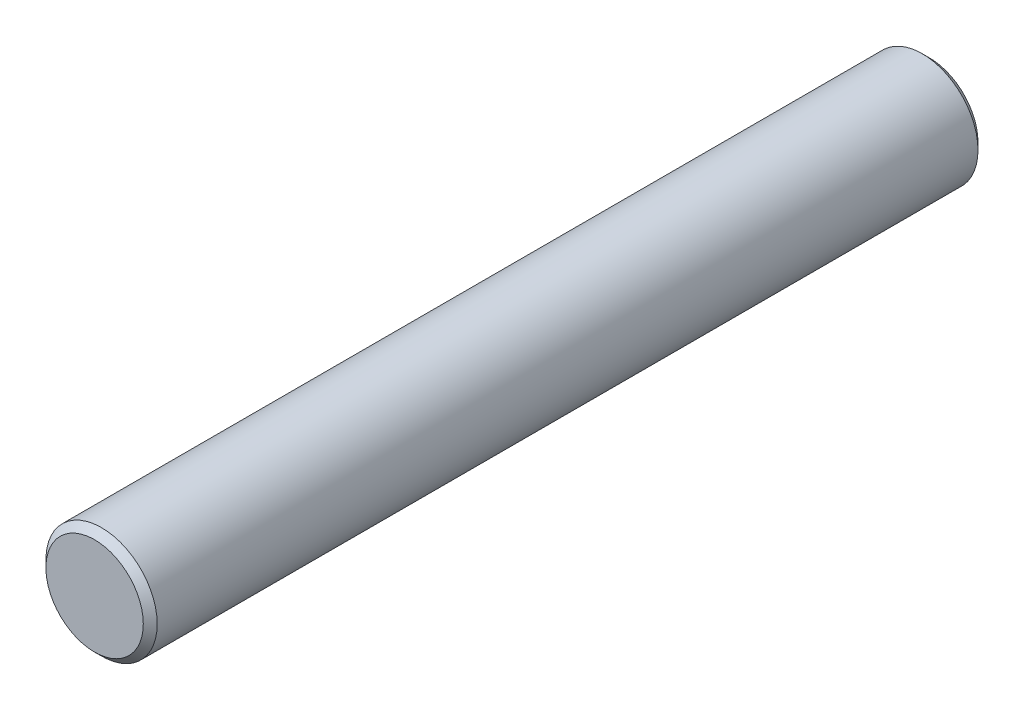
ISO-10303-21;
HEADER;
FILE_DESCRIPTION(('STEP AP214'),'2;1');
FILE_NAME('part.step','',(''),(''),'','','');
FILE_SCHEMA(('AUTOMOTIVE_DESIGN { 1 0 10303 214 1 1 1 1 }'));
ENDSEC;
DATA;
#1=APPLICATION_CONTEXT('core data for automotive mechanical design processes');
#2=APPLICATION_PROTOCOL_DEFINITION('international standard','automotive_design',2000,#1);
#3=PRODUCT_CONTEXT('',#1,'mechanical');
#4=PRODUCT('Part','Part','',(#3));
#5=PRODUCT_RELATED_PRODUCT_CATEGORY('part','',(#4));
#6=PRODUCT_DEFINITION_FORMATION('','',#4);
#7=PRODUCT_DEFINITION_CONTEXT('part definition',#1,'design');
#8=PRODUCT_DEFINITION('design','',#6,#7);
#9=PRODUCT_DEFINITION_SHAPE('','',#8);
#10=(LENGTH_UNIT() NAMED_UNIT(*) SI_UNIT(.MILLI.,.METRE.));
#11=(NAMED_UNIT(*) PLANE_ANGLE_UNIT() SI_UNIT($,.RADIAN.));
#12=(NAMED_UNIT(*) SI_UNIT($,.STERADIAN.) SOLID_ANGLE_UNIT());
#13=UNCERTAINTY_MEASURE_WITH_UNIT(LENGTH_MEASURE(1.E-05),#10,'distance_accuracy_value','');
#14=(GEOMETRIC_REPRESENTATION_CONTEXT(3) GLOBAL_UNCERTAINTY_ASSIGNED_CONTEXT((#13)) GLOBAL_UNIT_ASSIGNED_CONTEXT((#10,
#11,#12)) REPRESENTATION_CONTEXT('',''));
#15=CARTESIAN_POINT('',(0.,0.,0.));
#16=DIRECTION('',(0.,0.,1.));
#17=DIRECTION('',(1.,0.,0.));
#18=AXIS2_PLACEMENT_3D('',#15,#16,#17);
#19=CARTESIAN_POINT('',(0.,1.38777878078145E-13,120.));
#20=DIRECTION('',(0.,0.,-1.));
#21=DIRECTION('',(-1.00000000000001,0.,0.));
#22=AXIS2_PLACEMENT_3D('',#19,#20,#21);
#23=CYLINDRICAL_SURFACE('',#22,8.);
#24=CARTESIAN_POINT('',(1.11022302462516E-13,0.,119.));
#25=DIRECTION('',(0.,0.,1.));
#26=DIRECTION('',(1.00000000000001,0.,0.));
#27=AXIS2_PLACEMENT_3D('',#24,#25,#26);
#28=CIRCLE('',#27,8.);
#29=CARTESIAN_POINT('',(8.00000000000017,0.,119.));
#30=VERTEX_POINT('',#29);
#31=EDGE_CURVE('E33',#30,#30,#28,.F.);
#32=ORIENTED_EDGE('',*,*,#31,.T.);
#33=EDGE_LOOP('',(#32));
#34=FACE_BOUND('',#33,.T.);
#35=CARTESIAN_POINT('',(0.,0.,1.));
#36=DIRECTION('',(0.,0.,1.));
#37=DIRECTION('',(1.00000000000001,0.,0.));
#38=AXIS2_PLACEMENT_3D('',#35,#36,#37);
#39=CIRCLE('',#38,8.);
#40=CARTESIAN_POINT('',(8.00000000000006,0.,1.));
#41=VERTEX_POINT('',#40);
#42=EDGE_CURVE('E37',#41,#41,#39,.T.);
#43=ORIENTED_EDGE('',*,*,#42,.T.);
#44=EDGE_LOOP('',(#43));
#45=FACE_BOUND('',#44,.T.);
#46=ADVANCED_FACE('F27',(#34,#45),#23,.T.);
#47=CARTESIAN_POINT('',(0.,1.38777878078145E-13,120.));
#48=DIRECTION('',(0.,0.,1.));
#49=DIRECTION('',(1.00000000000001,0.,0.));
#50=AXIS2_PLACEMENT_3D('',#47,#48,#49);
#51=PLANE('',#50);
#52=CARTESIAN_POINT('',(0.,1.38777878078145E-13,120.));
#53=DIRECTION('',(0.,0.,1.));
#54=DIRECTION('',(1.00000000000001,0.,0.));
#55=AXIS2_PLACEMENT_3D('',#52,#53,#54);
#56=CIRCLE('',#55,7.);
#57=CARTESIAN_POINT('',(7.00000000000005,1.54321000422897E-13,120.));
#58=VERTEX_POINT('',#57);
#59=EDGE_CURVE('E41',#58,#58,#56,.T.);
#60=ORIENTED_EDGE('',*,*,#59,.T.);
#61=EDGE_LOOP('',(#60));
#62=FACE_BOUND('',#61,.T.);
#63=ADVANCED_FACE('F47',(#62),#51,.T.);
#64=CARTESIAN_POINT('',(0.,0.,0.));
#65=DIRECTION('',(0.,0.,1.));
#66=DIRECTION('',(1.00000000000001,0.,0.));
#67=AXIS2_PLACEMENT_3D('',#64,#65,#66);
#68=PLANE('',#67);
#69=CARTESIAN_POINT('',(0.,0.,0.));
#70=DIRECTION('',(0.,0.,1.));
#71=DIRECTION('',(1.00000000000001,0.,0.));
#72=AXIS2_PLACEMENT_3D('',#69,#70,#71);
#73=CIRCLE('',#72,7.);
#74=CARTESIAN_POINT('',(7.00000000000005,0.,0.));
#75=VERTEX_POINT('',#74);
#76=EDGE_CURVE('E10',#75,#75,#73,.F.);
#77=ORIENTED_EDGE('',*,*,#76,.T.);
#78=EDGE_LOOP('',(#77));
#79=FACE_BOUND('',#78,.T.);
#80=ADVANCED_FACE('F52',(#79),#68,.F.);
#81=CARTESIAN_POINT('',(0.,1.38777878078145E-13,120.));
#82=DIRECTION('',(0.,0.,-1.));
#83=DIRECTION('',(-1.00000000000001,0.,0.));
#84=AXIS2_PLACEMENT_3D('',#81,#82,#83);
#85=CONICAL_SURFACE('',#84,7.,0.785398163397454);
#86=ORIENTED_EDGE('',*,*,#31,.F.);
#87=EDGE_LOOP('',(#86));
#88=FACE_BOUND('',#87,.T.);
#89=ORIENTED_EDGE('',*,*,#59,.F.);
#90=EDGE_LOOP('',(#89));
#91=FACE_BOUND('',#90,.T.);
#92=ADVANCED_FACE('F49',(#88,#91),#85,.T.);
#93=CARTESIAN_POINT('',(0.,0.,1.));
#94=DIRECTION('',(0.,0.,1.));
#95=DIRECTION('',(1.00000000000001,0.,0.));
#96=AXIS2_PLACEMENT_3D('',#93,#94,#95);
#97=CONICAL_SURFACE('',#96,8.,0.785398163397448);
#98=ORIENTED_EDGE('',*,*,#76,.F.);
#99=EDGE_LOOP('',(#98));
#100=FACE_BOUND('',#99,.T.);
#101=ORIENTED_EDGE('',*,*,#42,.F.);
#102=EDGE_LOOP('',(#101));
#103=FACE_BOUND('',#102,.T.);
#104=ADVANCED_FACE('F51',(#100,#103),#97,.T.);
#105=CLOSED_SHELL('',(#46,#63,#80,#92,#104));
#106=MANIFOLD_SOLID_BREP('B2',#105);
#107=ADVANCED_BREP_SHAPE_REPRESENTATION('',(#18,#106),#14);
#108=SHAPE_DEFINITION_REPRESENTATION(#9,#107);
ENDSEC;
END-ISO-10303-21;
